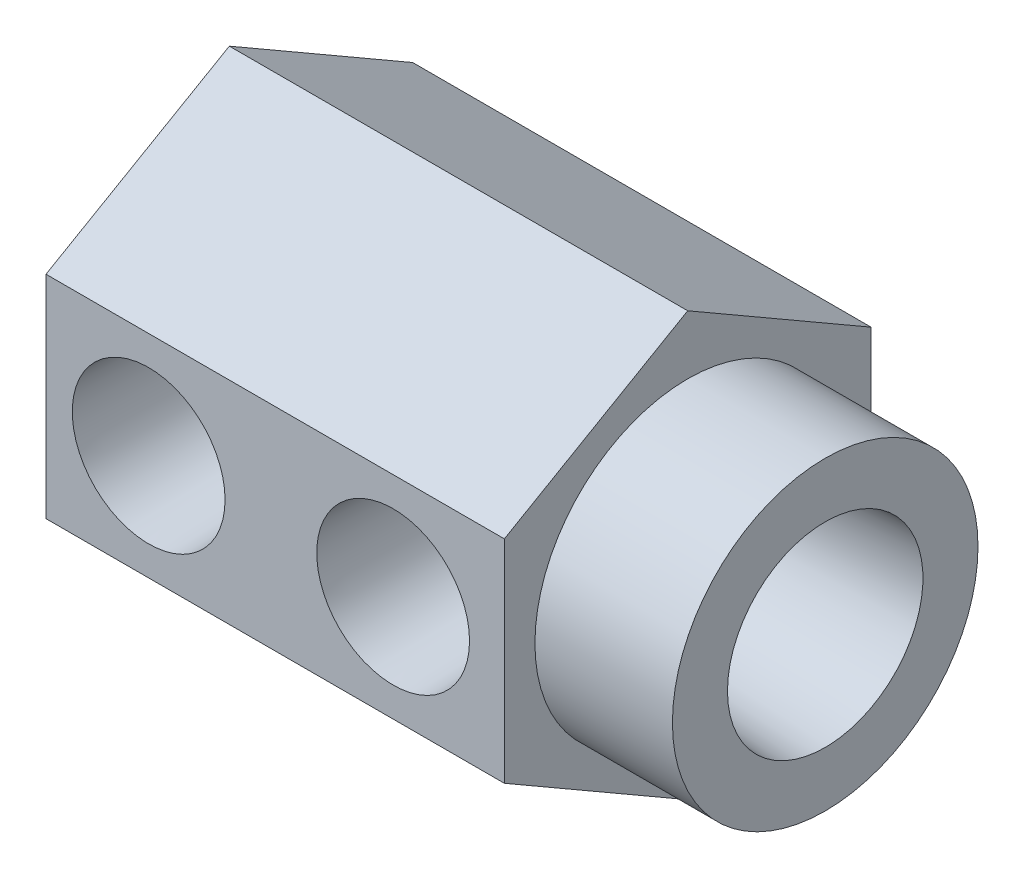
from build123d import *

# Parameters (mm, degrees)
BOSS_EXTRUDE1_DEPTH                = 23.8125
SKETCH2_R                          = 7.9375
BOSS_EXTRUDE2_DEPTH                = 7.14375
F_1_16_NPT_TAPPED_HOLE2_AT_2_COUNT = 2
F_1_16_NPT_TAPPED_HOLE2_AT_2_PITCH = 12.7
F_1_4_28_TAPPED_HOLE1_D            = 5.4102
F_1_4_28_TAPPED_HOLE1_DEPTH        = 24.94534
F_1_4_28_TAPPED_HOLE1_CBORE_D      = 6.35
F_1_4_28_TAPPED_HOLE1_CBORE_DEPTH  = 22.86
F_1_4_28_TAPPED_HOLE1_TIP          = 1.625388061


with BuildPart() as part:
    # Sketch1 → Boss-Extrude1 (new body)
    with BuildSketch(Plane(origin=(0, 0, 0), x_dir=(0, 0, -1), z_dir=(1, 0, 0))):
        Polygon((9.525, -5.499261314), (9.525, 5.499261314), (0, 10.998522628), (-9.525, 5.499261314), (-9.525, -5.499261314), (0, -10.998522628), align=None)
    extrude(amount=BOSS_EXTRUDE1_DEPTH)

    # Sketch2 → Boss-Extrude2 (add)
    with BuildSketch(Plane(origin=(23.8125, 0, 0), x_dir=(0, 0, -1), z_dir=(1, 0, 0))):
        Circle(SKETCH2_R)
    extrude(amount=BOSS_EXTRUDE2_DEPTH)

    # Sketch3 → Cut-Revolve1 (revolve, cut)
    with BuildSketch(Plane(origin=(0, 0, 0), x_dir=(1, 0, 0), z_dir=(0, 1, 0)), mode=Mode.PRIVATE) as cut_revolve1_sk:
        Polygon((30.95625, 0), (30.95625, 5.07746), (23.97125, 4.711391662), (23.97125, 3.4163), (14.31925, 3.4163), (14.31925, 0), align=None)
    revolve(cut_revolve1_sk.sketch.rotate(Axis((-5.616376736, 0, 0), (1, 0, 0)), 180), axis=Axis((-5.616376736, 0, 0), (1, 0, 0)), mode=Mode.SUBTRACT)

    # Sketch4 → 1_16 NPT Tapped Hole1 (revolve, cut)
    with BuildSketch(Plane(origin=(5.334, 0, -9.525), x_dir=(0, 1, 0), z_dir=(1, 0, 0))):
        Polygon((0, 0), (0, 13.436705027), (3.0734, 11.59002), (3.0734, 6.88594), (3.762575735, 6.88594), (3.96875, 0), align=None)
    revolve(axis=Axis((5.334, 0, -15.875), (0, 0, 1)), mode=Mode.SUBTRACT)

    # Sketch6 → 1_16 NPT Tapped Hole2 (revolve, cut)
    with BuildSketch(Plane(origin=(5.334, 0, 9.525), x_dir=(0, -1, 0), z_dir=(1, 0, 0))):
        Polygon((0, 0), (0, 17.721685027), (3.0734, 15.875), (3.0734, 6.88594), (3.762575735, 6.88594), (3.96875, 0), align=None)
    f_1_16_npt_tapped_hole2 = revolve(axis=Axis((5.334, 0, 15.875), (0, 0, -1)), mode=Mode.SUBTRACT)

    # 1_16 NPT Tapped Hole2 at 2: 1_16 NPT Tapped Hole2 ×2
    with Locations(*[(i * F_1_16_NPT_TAPPED_HOLE2_AT_2_PITCH, 0, 0) for i in range(1, F_1_16_NPT_TAPPED_HOLE2_AT_2_COUNT)]):
        add(f_1_16_npt_tapped_hole2, mode=Mode.SUBTRACT)

    # 1_4-28 Tapped Hole1
    with Locations(Plane(origin=(30.95625, 0, 0), x_dir=(0, 0, -1), z_dir=(1, 0, 0))):
        with Locations((0, 0)):
            CounterBoreHole(F_1_4_28_TAPPED_HOLE1_D / 2, F_1_4_28_TAPPED_HOLE1_CBORE_D / 2, F_1_4_28_TAPPED_HOLE1_CBORE_DEPTH, depth=F_1_4_28_TAPPED_HOLE1_DEPTH)
            with Locations((0, 0, -(F_1_4_28_TAPPED_HOLE1_DEPTH + F_1_4_28_TAPPED_HOLE1_TIP / 2))):  # 118° drill point
                Cone(0, F_1_4_28_TAPPED_HOLE1_D / 2, F_1_4_28_TAPPED_HOLE1_TIP, mode=Mode.SUBTRACT)


solid = part.part
